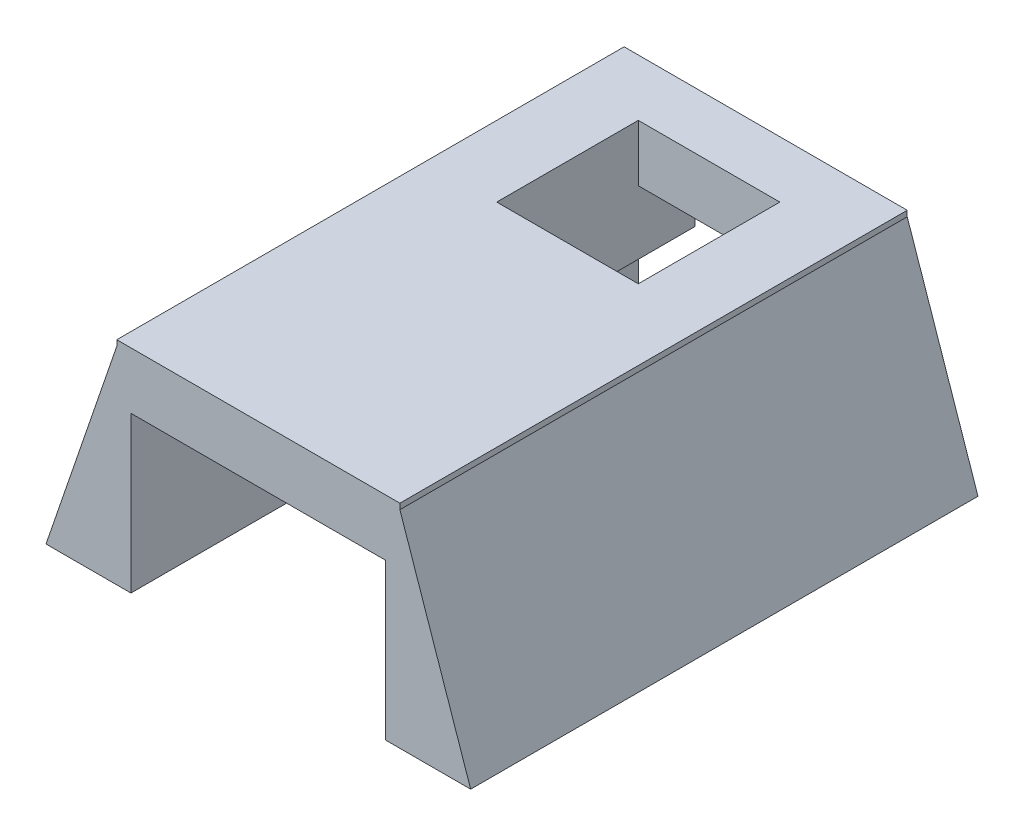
from build123d import *

# Parameters (mm, degrees)
BOSS_EXTRUDE1_DEPTH = 19.92051609
CUT_EXTRUDE3_DEPTH  = 5.5
SKETCH5_W           = 9
SKETCH5_H           = 3.25
CUT_EXTRUDE5_DEPTH  = 23.568273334
SKETCH6_W           = 12
SKETCH6_H           = 2
BOSS_EXTRUDE2_DEPTH = 3.25
SKETCH7_W           = 7.058859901
SKETCH7_H           = 2
BOSS_EXTRUDE3_DEPTH = 6
SKETCH4_W           = 5
SKETCH4_H           = 5
CUT_EXTRUDE4_DEPTH  = 23.568273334
CUT_EXTRUDE6_REACH  = 24.568
SKETCH8_W           = 15
SKETCH8_H           = 2


with BuildPart() as part:
    # Sketch2 → Boss-Extrude1 (new body)
    with BuildSketch(Plane.XY):
        Polygon((-7.5, 0), (-5, 7.3), (-5, 7.5), (5, 7.5), (5, 7.3), (7.5, 0), align=None)
    extrude(amount=BOSS_EXTRUDE1_DEPTH)

    # Sketch3 → Cut-Extrude3 (cut)
    with BuildSketch(Plane(origin=(0, 0, 0), x_dir=(1, 0, 0), z_dir=(0, 1, 0))):
        Polygon((-4.5, -19.92051609), (4.5, -19.92051609), (4.5, -11), (2.5, -11), (2.5, 0), (-2.5, 0), (-2.5, -11), (-4.5, -11), align=None)
    extrude(amount=CUT_EXTRUDE3_DEPTH, mode=Mode.SUBTRACT)

    # Sketch5 → Cut-Extrude5 (cut, through all)
    with BuildSketch(Plane(origin=(0, 0, 0), x_dir=(-1, 0, 0), z_dir=(0, 0, -1))):
        with Locations((0, 1.625)):
            Rectangle(SKETCH5_W, SKETCH5_H)
    extrude(amount=-CUT_EXTRUDE5_DEPTH, mode=Mode.SUBTRACT)

    # Sketch6 → Boss-Extrude2 (add)
    with BuildSketch(Plane.XZ.offset(-3.25)):
        with Locations((0, 1)):
            Rectangle(SKETCH6_W, SKETCH6_H)
    extrude(amount=BOSS_EXTRUDE2_DEPTH)

    # Sketch7 → Boss-Extrude3 (add)
    with BuildSketch(Plane.XZ):
        with Locations((0.029429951, 1)):
            Rectangle(SKETCH7_W, SKETCH7_H)
    extrude(amount=-BOSS_EXTRUDE3_DEPTH)

    # Sketch4 → Cut-Extrude4 (cut, through all)
    with BuildSketch(Plane(origin=(0, 7.5, 0), x_dir=(1, 0, 0), z_dir=(0, 1, 0))):
        with Locations((0, -6.5)):
            Rectangle(SKETCH4_W, SKETCH4_H)
    extrude(amount=-CUT_EXTRUDE4_DEPTH, mode=Mode.SUBTRACT)

    # Sketch8 → Cut-Extrude6 (cut, up to next)
    with BuildSketch(Plane.XZ, mode=Mode.PRIVATE) as cut_extrude6_sk1:
        with Locations((0, 1)):
            Rectangle(SKETCH8_W, SKETCH8_H)
    cut_extrude6_tool1 = extrude(cut_extrude6_sk1.sketch, amount=-CUT_EXTRUDE6_REACH, mode=Mode.PRIVATE) & part.part
    add(cut_extrude6_tool1.solids().sort_by_distance((0, 0, 1))[0], mode=Mode.SUBTRACT)


solid = part.part
